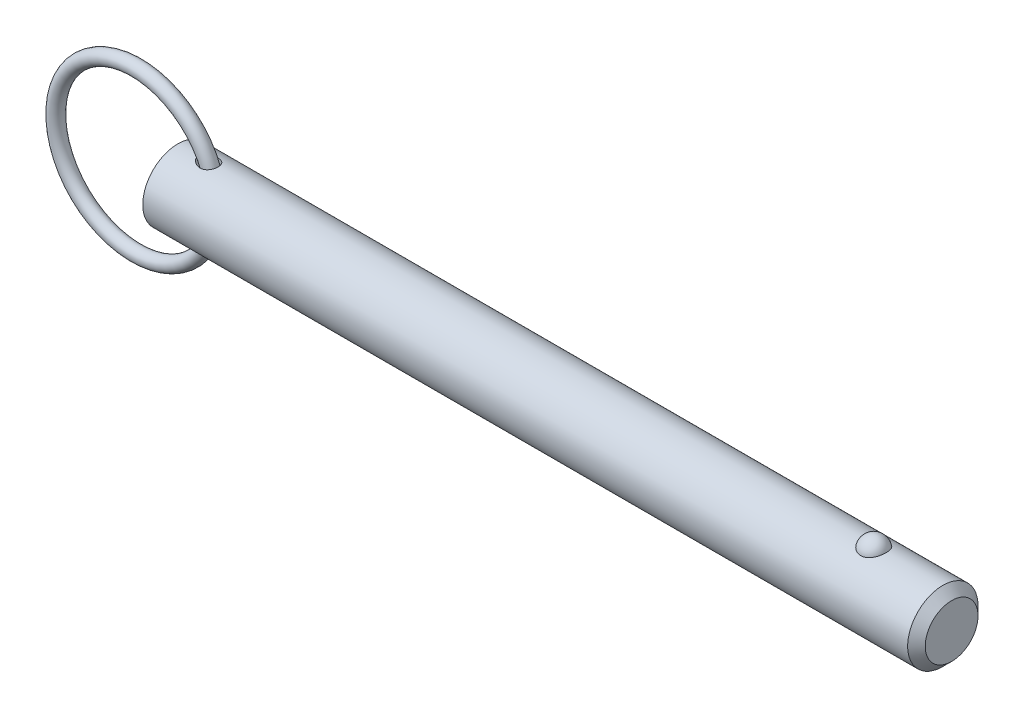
ISO-10303-21;
HEADER;
FILE_DESCRIPTION(('STEP AP214'),'2;1');
FILE_NAME('part.step','',(''),(''),'','','');
FILE_SCHEMA(('AUTOMOTIVE_DESIGN { 1 0 10303 214 1 1 1 1 }'));
ENDSEC;
DATA;
#1=APPLICATION_CONTEXT('core data for automotive mechanical design processes');
#2=APPLICATION_PROTOCOL_DEFINITION('international standard','automotive_design',2000,#1);
#3=PRODUCT_CONTEXT('',#1,'mechanical');
#4=PRODUCT('Part','Part','',(#3));
#5=PRODUCT_RELATED_PRODUCT_CATEGORY('part','',(#4));
#6=PRODUCT_DEFINITION_FORMATION('','',#4);
#7=PRODUCT_DEFINITION_CONTEXT('part definition',#1,'design');
#8=PRODUCT_DEFINITION('design','',#6,#7);
#9=PRODUCT_DEFINITION_SHAPE('','',#8);
#10=(LENGTH_UNIT() NAMED_UNIT(*) SI_UNIT(.MILLI.,.METRE.));
#11=(NAMED_UNIT(*) PLANE_ANGLE_UNIT() SI_UNIT($,.RADIAN.));
#12=(NAMED_UNIT(*) SI_UNIT($,.STERADIAN.) SOLID_ANGLE_UNIT());
#13=UNCERTAINTY_MEASURE_WITH_UNIT(LENGTH_MEASURE(1.E-05),#10,'distance_accuracy_value','');
#14=(GEOMETRIC_REPRESENTATION_CONTEXT(3) GLOBAL_UNCERTAINTY_ASSIGNED_CONTEXT((#13)) GLOBAL_UNIT_ASSIGNED_CONTEXT((#10,
#11,#12)) REPRESENTATION_CONTEXT('',''));
#15=CARTESIAN_POINT('',(0.,0.,0.));
#16=DIRECTION('',(0.,0.,1.));
#17=DIRECTION('',(1.,0.,0.));
#18=AXIS2_PLACEMENT_3D('',#15,#16,#17);
#19=CARTESIAN_POINT('',(-6.5973878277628,0.,0.));
#20=DIRECTION('',(0.,0.,1.));
#21=DIRECTION('',(1.,0.,0.));
#22=AXIS2_PLACEMENT_3D('',#19,#20,#21);
#23=TOROIDAL_SURFACE('',#22,12.7,1.111);
#24=CARTESIAN_POINT('',(7.21361217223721,0.,0.));
#25=VERTEX_POINT('',#24);
#26=VERTEX_LOOP('',#25);
#27=FACE_BOUND('',#26,.T.);
#28=ADVANCED_FACE('P0_F12',(#27),#23,.T.);
#29=CLOSED_SHELL('',(#28));
#30=MANIFOLD_SOLID_BREP('P0_B1',#29);
#31=CARTESIAN_POINT('',(0.,0.,0.));
#32=DIRECTION('',(1.,0.,0.));
#33=DIRECTION('',(0.,0.,-1.));
#34=AXIS2_PLACEMENT_3D('',#31,#32,#33);
#35=CYLINDRICAL_SURFACE('',#34,5.555);
#36=CARTESIAN_POINT('',(3.4079629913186,5.52646850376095,-0.56229074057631));
#37=CARTESIAN_POINT('',(3.45038002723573,5.51879026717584,-0.637753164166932));
#38=CARTESIAN_POINT('',(3.50032814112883,5.50998541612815,-0.70889136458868));
#39=CARTESIAN_POINT('',(3.61174203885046,5.49132550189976,-0.841353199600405));
#40=CARTESIAN_POINT('',(3.67323300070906,5.48146816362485,-0.902654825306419));
#41=CARTESIAN_POINT('',(3.80437942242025,5.46186986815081,-1.01449227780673));
#42=CARTESIAN_POINT('',(3.87396236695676,5.45212862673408,-1.06511378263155));
#43=CARTESIAN_POINT('',(4.01965973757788,5.43359578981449,-1.15594541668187));
#44=CARTESIAN_POINT('',(4.09577226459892,5.42480391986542,-1.19615855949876));
#45=CARTESIAN_POINT('',(4.26620236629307,5.40764958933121,-1.27165209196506));
#46=CARTESIAN_POINT('',(4.36143030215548,5.3996073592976,-1.30496908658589));
#47=CARTESIAN_POINT('',(4.55632904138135,5.38707461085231,-1.35578120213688));
#48=CARTESIAN_POINT('',(4.65600230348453,5.38258608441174,-1.37326745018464));
#49=CARTESIAN_POINT('',(4.85802759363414,5.37803111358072,-1.3910078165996));
#50=CARTESIAN_POINT('',(4.96039620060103,5.37800782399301,-1.39109376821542));
#51=CARTESIAN_POINT('',(5.16321961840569,5.38288845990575,-1.37209481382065));
#52=CARTESIAN_POINT('',(5.26367660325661,5.38778639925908,-1.3530331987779));
#53=CARTESIAN_POINT('',(5.44616808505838,5.40112654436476,-1.29866014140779));
#54=CARTESIAN_POINT('',(5.52893514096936,5.40904875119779,-1.26567968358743));
#55=CARTESIAN_POINT('',(5.68656142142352,5.4273273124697,-1.18484144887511));
#56=CARTESIAN_POINT('',(5.76142575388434,5.43768208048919,-1.13699336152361));
#57=CARTESIAN_POINT('',(5.8928378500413,5.45821422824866,-1.03362464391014));
#58=CARTESIAN_POINT('',(5.95048930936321,5.4682911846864,-0.979480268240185));
#59=CARTESIAN_POINT('',(6.05543937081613,5.48805232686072,-0.861887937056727));
#60=CARTESIAN_POINT('',(6.10274018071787,5.4977365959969,-0.798441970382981));
#61=CARTESIAN_POINT('',(6.18429732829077,5.51527779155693,-0.666351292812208));
#62=CARTESIAN_POINT('',(6.2189304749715,5.52318421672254,-0.597945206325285));
#63=CARTESIAN_POINT('',(6.27643902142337,5.53669785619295,-0.456146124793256));
#64=CARTESIAN_POINT('',(6.299314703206,5.54230512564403,-0.382753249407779));
#65=CARTESIAN_POINT('',(6.33280284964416,5.55061821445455,-0.232999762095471));
#66=CARTESIAN_POINT('',(6.34340498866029,5.55332159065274,-0.156636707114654));
#67=CARTESIAN_POINT('',(6.35208224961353,5.55552923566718,-0.00315477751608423));
#68=CARTESIAN_POINT('',(6.3501570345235,5.55503341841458,0.0739641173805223));
#69=CARTESIAN_POINT('',(6.33379320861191,5.55088854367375,0.22702996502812));
#70=CARTESIAN_POINT('',(6.31931424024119,5.54722931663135,0.302972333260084));
#71=CARTESIAN_POINT('',(6.27810810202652,5.53713917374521,0.451265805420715));
#72=CARTESIAN_POINT('',(6.25138106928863,5.53070828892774,0.523616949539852));
#73=CARTESIAN_POINT('',(6.18634700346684,5.51578851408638,0.662556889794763));
#74=CARTESIAN_POINT('',(6.14805666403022,5.50730259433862,0.729153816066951));
#75=CARTESIAN_POINT('',(6.0608417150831,5.4892059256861,0.854797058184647));
#76=CARTESIAN_POINT('',(6.01191805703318,5.47959527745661,0.91384404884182));
#77=CARTESIAN_POINT('',(5.90496974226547,5.46035411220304,1.0225462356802));
#78=CARTESIAN_POINT('',(5.84698163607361,5.45072382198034,1.07223745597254));
#79=CARTESIAN_POINT('',(5.72342907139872,5.43245016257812,1.16128533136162));
#80=CARTESIAN_POINT('',(5.65786492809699,5.42380675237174,1.20064241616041));
#81=CARTESIAN_POINT('',(5.52033184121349,5.40830592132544,1.26865612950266));
#82=CARTESIAN_POINT('',(5.44830127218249,5.40146883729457,1.29719236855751));
#83=CARTESIAN_POINT('',(5.30051649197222,5.39032432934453,1.34275086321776));
#84=CARTESIAN_POINT('',(5.22476137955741,5.38601752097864,1.35977031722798));
#85=CARTESIAN_POINT('',(5.06697568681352,5.38004503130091,1.3832203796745));
#86=CARTESIAN_POINT('',(4.98483834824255,5.37854992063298,1.38896799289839));
#87=CARTESIAN_POINT('',(4.82062075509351,5.37866467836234,1.38851901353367));
#88=CARTESIAN_POINT('',(4.73854053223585,5.38027567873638,1.38231806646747));
#89=CARTESIAN_POINT('',(4.56659703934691,5.38661928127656,1.35740374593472));
#90=CARTESIAN_POINT('',(4.47694676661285,5.39169506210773,1.33731128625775));
#91=CARTESIAN_POINT('',(4.30168169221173,5.40457769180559,1.28425210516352));
#92=CARTESIAN_POINT('',(4.2160714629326,5.41238755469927,1.25127117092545));
#93=CARTESIAN_POINT('',(4.04117722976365,5.43085841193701,1.16867508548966));
#94=CARTESIAN_POINT('',(3.95261220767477,5.44174460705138,1.11757796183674));
#95=CARTESIAN_POINT('',(3.78568183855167,5.46440376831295,1.00091858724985));
#96=CARTESIAN_POINT('',(3.70730710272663,5.47617590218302,0.935369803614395));
#97=CARTESIAN_POINT('',(3.5829937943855,5.49603821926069,0.809043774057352));
#98=CARTESIAN_POINT('',(3.5339020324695,5.50429522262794,0.751392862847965));
#99=CARTESIAN_POINT('',(3.44556991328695,5.51963490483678,0.628847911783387));
#100=CARTESIAN_POINT('',(3.40631385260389,5.52671944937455,0.563965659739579));
#101=CARTESIAN_POINT('',(3.34553998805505,5.5379053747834,0.439181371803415));
#102=CARTESIAN_POINT('',(3.32216705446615,5.5423057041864,0.380214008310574));
#103=CARTESIAN_POINT('',(3.2854368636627,5.54928356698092,0.259119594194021));
#104=CARTESIAN_POINT('',(3.27207322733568,5.5518622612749,0.196994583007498));
#105=CARTESIAN_POINT('',(3.25633559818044,5.5549036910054,0.0710541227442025));
#106=CARTESIAN_POINT('',(3.25400356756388,5.5553583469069,0.00723314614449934));
#107=CARTESIAN_POINT('',(3.26064251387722,5.55407150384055,-0.119787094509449));
#108=CARTESIAN_POINT('',(3.26961302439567,5.55233009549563,-0.182986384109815));
#109=CARTESIAN_POINT('',(3.29666795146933,5.54714559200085,-0.30051820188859));
#110=CARTESIAN_POINT('',(3.31373453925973,5.54389322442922,-0.355099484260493));
#111=CARTESIAN_POINT('',(3.35543396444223,5.53607951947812,-0.461174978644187));
#112=CARTESIAN_POINT('',(3.38007019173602,5.5315175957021,-0.512667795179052));
#113=CARTESIAN_POINT('',(3.4079629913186,5.52646850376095,-0.56229074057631));
#114=B_SPLINE_CURVE_WITH_KNOTS('',3,(#36,#37,#38,#39,#40,#41,#42,#43,#44,#45,#46,#47,#48,#49,
#50,#51,#52,#53,#54,#55,#56,#57,#58,#59,#60,#61,#62,#63,#64,#65,#66,#67,#68,#69,#70,#71,#72,#73,
#74,#75,#76,#77,#78,#79,#80,#81,#82,#83,#84,#85,#86,#87,#88,#89,#90,#91,#92,#93,#94,#95,#96,#97,
#98,#99,#100,#101,#102,#103,#104,#105,#106,#107,#108,#109,#110,#111,#112,#113),.UNSPECIFIED.,
.T.,.F.,(4,2,2,2,2,2,2,2,2,2,2,2,2,2,2,2,2,2,2,2,2,2,2,2,2,2,2,2,2,2,2,2,2,2,2,2,2,2,4),(0.,
0.260459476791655,0.521493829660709,0.780346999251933,1.03912513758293,1.34137402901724,
1.64379222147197,1.94913302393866,2.25410286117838,2.52092363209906,2.78757087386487,
3.0255756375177,3.26352958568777,3.49368251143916,3.72382991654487,3.9541708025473,
4.18451788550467,4.41560824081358,4.64669600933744,4.87745174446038,5.10818684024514,
5.33801446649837,5.56783253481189,5.80013729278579,6.03249854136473,6.27855081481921,
6.5246927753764,6.79963372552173,7.07487872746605,7.38193573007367,7.68870779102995,
7.91639390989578,8.14371416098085,8.33366541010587,8.52349549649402,8.71404708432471,
8.90459080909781,9.07578823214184,9.24706243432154),.UNSPECIFIED.);
#115=CARTESIAN_POINT('',(3.4079629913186,5.52646850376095,-0.56229074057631));
#116=VERTEX_POINT('',#115);
#117=EDGE_CURVE('P1_E40',#116,#116,#114,.T.);
#118=ORIENTED_EDGE('',*,*,#117,.T.);
#119=EDGE_LOOP('',(#118));
#120=FACE_BOUND('',#119,.T.);
#121=CARTESIAN_POINT('',(120.83125,0.,0.));
#122=DIRECTION('',(1.,0.,0.));
#123=DIRECTION('',(0.,0.,-1.));
#124=AXIS2_PLACEMENT_3D('',#121,#122,#123);
#125=CIRCLE('',#124,5.555);
#126=CARTESIAN_POINT('',(120.83125,0.,-5.555));
#127=VERTEX_POINT('',#126);
#128=EDGE_CURVE('P1_E25',#127,#127,#125,.T.);
#129=ORIENTED_EDGE('',*,*,#128,.F.);
#130=EDGE_LOOP('',(#129));
#131=FACE_BOUND('',#130,.T.);
#132=CARTESIAN_POINT('',(0.,0.,0.));
#133=DIRECTION('',(1.,0.,0.));
#134=DIRECTION('',(0.,0.,-1.));
#135=AXIS2_PLACEMENT_3D('',#132,#133,#134);
#136=CIRCLE('',#135,5.555);
#137=CARTESIAN_POINT('',(0.,0.,-5.555));
#138=VERTEX_POINT('',#137);
#139=EDGE_CURVE('P1_E9',#138,#138,#136,.T.);
#140=ORIENTED_EDGE('',*,*,#139,.T.);
#141=EDGE_LOOP('',(#140));
#142=FACE_BOUND('',#141,.T.);
#143=CARTESIAN_POINT('',(109.918626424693,5.16741224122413,2.03859650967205));
#144=CARTESIAN_POINT('',(109.812949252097,5.16740893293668,2.03859990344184));
#145=CARTESIAN_POINT('',(109.70729894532,5.17079470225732,2.03008306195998));
#146=CARTESIAN_POINT('',(109.499141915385,5.18392795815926,1.9963072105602));
#147=CARTESIAN_POINT('',(109.396634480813,5.19367399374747,1.9710520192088));
#148=CARTESIAN_POINT('',(109.197771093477,5.21839168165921,1.90463997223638));
#149=CARTESIAN_POINT('',(109.101406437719,5.23335573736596,1.86350622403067));
#150=CARTESIAN_POINT('',(108.917080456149,5.26688076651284,1.76652592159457));
#151=CARTESIAN_POINT('',(108.829120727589,5.28544242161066,1.71067657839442));
#152=CARTESIAN_POINT('',(108.661265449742,5.32479845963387,1.58399959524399));
#153=CARTESIAN_POINT('',(108.58166564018,5.34564089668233,1.51279545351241));
#154=CARTESIAN_POINT('',(108.43512901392,5.38697258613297,1.35828584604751));
#155=CARTESIAN_POINT('',(108.368194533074,5.40746177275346,1.27497815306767));
#156=CARTESIAN_POINT('',(108.24561039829,5.44694508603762,1.09440293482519));
#157=CARTESIAN_POINT('',(108.190598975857,5.46583143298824,0.996677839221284));
#158=CARTESIAN_POINT('',(108.096937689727,5.49908030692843,0.792961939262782));
#159=CARTESIAN_POINT('',(108.058289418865,5.513442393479,0.686970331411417));
#160=CARTESIAN_POINT('',(107.997680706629,5.536358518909,0.468019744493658));
#161=CARTESIAN_POINT('',(107.975972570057,5.54482455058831,0.35498154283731));
#162=CARTESIAN_POINT('',(107.950636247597,5.55473324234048,0.126595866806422));
#163=CARTESIAN_POINT('',(107.947007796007,5.55617600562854,0.0112484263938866));
#164=CARTESIAN_POINT('',(107.957881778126,5.55189984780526,-0.218011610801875));
#165=CARTESIAN_POINT('',(107.972315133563,5.54620821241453,-0.331928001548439));
#166=CARTESIAN_POINT('',(108.018903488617,5.52828920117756,-0.555544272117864));
#167=CARTESIAN_POINT('',(108.051058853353,5.5160616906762,-0.665244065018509));
#168=CARTESIAN_POINT('',(108.132488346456,5.48630779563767,-0.877469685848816));
#169=CARTESIAN_POINT('',(108.181781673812,5.4687754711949,-0.979987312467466));
#170=CARTESIAN_POINT('',(108.296478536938,5.43024700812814,-1.17486975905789));
#171=CARTESIAN_POINT('',(108.361883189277,5.4092506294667,-1.26723387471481));
#172=CARTESIAN_POINT('',(108.507571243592,5.36600927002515,-1.43940133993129));
#173=CARTESIAN_POINT('',(108.587885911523,5.34376173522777,-1.5191776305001));
#174=CARTESIAN_POINT('',(108.761452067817,5.30057971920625,-1.66360338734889));
#175=CARTESIAN_POINT('',(108.854702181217,5.27964509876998,-1.72825445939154));
#176=CARTESIAN_POINT('',(109.049393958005,5.24205250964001,-1.8390947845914));
#177=CARTESIAN_POINT('',(109.150590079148,5.22530519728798,-1.88568407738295));
#178=CARTESIAN_POINT('',(109.360155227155,5.19750919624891,-1.96100802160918));
#179=CARTESIAN_POINT('',(109.468521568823,5.18645838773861,-1.98974931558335));
#180=CARTESIAN_POINT('',(109.683498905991,5.17184410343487,-2.02742262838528));
#181=CARTESIAN_POINT('',(109.789925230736,5.16793282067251,-2.0372760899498));
#182=CARTESIAN_POINT('',(110.002992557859,5.1669899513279,-2.03966777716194));
#183=CARTESIAN_POINT('',(110.109633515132,5.16995704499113,-2.03220932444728));
#184=CARTESIAN_POINT('',(110.316773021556,5.18222383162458,-2.0007117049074));
#185=CARTESIAN_POINT('',(110.417359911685,5.19133213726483,-1.97717337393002));
#186=CARTESIAN_POINT('',(110.613014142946,5.21467637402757,-1.91475248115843));
#187=CARTESIAN_POINT('',(110.708081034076,5.22891272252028,-1.87586867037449));
#188=CARTESIAN_POINT('',(110.892371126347,5.26137066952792,-1.78282713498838));
#189=CARTESIAN_POINT('',(110.981419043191,5.27967329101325,-1.7283512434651));
#190=CARTESIAN_POINT('',(111.149288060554,5.31817411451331,-1.60597483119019));
#191=CARTESIAN_POINT('',(111.228106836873,5.33837274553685,-1.53807126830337));
#192=CARTESIAN_POINT('',(111.377515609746,5.37968287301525,-1.38688970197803));
#193=CARTESIAN_POINT('',(111.447505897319,5.40079011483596,-1.30301744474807));
#194=CARTESIAN_POINT('',(111.573012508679,5.44074401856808,-1.12458170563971));
#195=CARTESIAN_POINT('',(111.628526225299,5.4595902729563,-1.03001630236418));
#196=CARTESIAN_POINT('',(111.725550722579,5.49369849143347,-0.829439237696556));
#197=CARTESIAN_POINT('',(111.766548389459,5.50882422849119,-0.723155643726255));
#198=CARTESIAN_POINT('',(111.831125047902,5.53310911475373,-0.504772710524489));
#199=CARTESIAN_POINT('',(111.854703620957,5.54226812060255,-0.392673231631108));
#200=CARTESIAN_POINT('',(111.884013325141,5.55370358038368,-0.165459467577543));
#201=CARTESIAN_POINT('',(111.889688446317,5.55595843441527,-0.0503368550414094));
#202=CARTESIAN_POINT('',(111.882916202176,5.55329317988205,0.179288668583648));
#203=CARTESIAN_POINT('',(111.870469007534,5.54837313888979,0.293791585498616));
#204=CARTESIAN_POINT('',(111.827779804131,5.53189037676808,0.518526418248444));
#205=CARTESIAN_POINT('',(111.797598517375,5.5203503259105,0.62877154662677));
#206=CARTESIAN_POINT('',(111.720096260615,5.49182453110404,0.84231815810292));
#207=CARTESIAN_POINT('',(111.672774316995,5.47483847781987,0.945619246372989));
#208=CARTESIAN_POINT('',(111.561720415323,5.43710633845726,1.14281571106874));
#209=CARTESIAN_POINT('',(111.497921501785,5.41634501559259,1.23667048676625));
#210=CARTESIAN_POINT('',(111.355357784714,5.37334572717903,1.4118524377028));
#211=CARTESIAN_POINT('',(111.27659323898,5.35110778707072,1.49317982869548));
#212=CARTESIAN_POINT('',(111.106423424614,5.30779474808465,1.64049162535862));
#213=CARTESIAN_POINT('',(111.01510026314,5.28671324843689,1.70656877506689));
#214=CARTESIAN_POINT('',(110.821739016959,5.2480485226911,1.82201372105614));
#215=CARTESIAN_POINT('',(110.719700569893,5.23046541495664,1.87138095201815));
#216=CARTESIAN_POINT('',(110.503618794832,5.20042692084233,1.95335298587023));
#217=CARTESIAN_POINT('',(110.389260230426,5.18820192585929,1.98521734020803));
#218=CARTESIAN_POINT('',(110.156130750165,5.17169804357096,2.02783294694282));
#219=CARTESIAN_POINT('',(110.037361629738,5.16741595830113,2.03859269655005));
#220=CARTESIAN_POINT('',(109.918626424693,5.16741224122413,2.03859650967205));
#221=B_SPLINE_CURVE_WITH_KNOTS('',3,(#143,#144,#145,#146,#147,#148,#149,#150,#151,#152,#153,
#154,#155,#156,#157,#158,#159,#160,#161,#162,#163,#164,#165,#166,#167,#168,#169,#170,#171,#172,
#173,#174,#175,#176,#177,#178,#179,#180,#181,#182,#183,#184,#185,#186,#187,#188,#189,#190,#191,
#192,#193,#194,#195,#196,#197,#198,#199,#200,#201,#202,#203,#204,#205,#206,#207,#208,#209,#210,
#211,#212,#213,#214,#215,#216,#217,#218,#219,#220),.UNSPECIFIED.,.T.,.F.,(4,2,2,2,2,2,2,2,2,2,2,
2,2,2,2,2,2,2,2,2,2,2,2,2,2,2,2,2,2,2,2,2,2,2,2,2,2,2,4),(0.,0.316595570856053,
0.633118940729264,0.949183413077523,1.26530783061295,1.59030762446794,1.91536729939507,
2.25495824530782,2.59458224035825,2.93917283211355,3.28375835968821,3.62703002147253,
3.97030875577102,4.3139732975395,4.65766166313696,5.00207904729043,5.3464598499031,
5.68270547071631,6.0188258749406,6.33808403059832,6.65728093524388,6.96696376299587,
7.27667180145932,7.59321535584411,7.90983070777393,8.24210387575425,8.57443684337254,
8.91755896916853,9.26068933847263,9.60489211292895,9.949091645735,10.2921194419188,
10.6351667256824,10.9796305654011,11.324088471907,11.666392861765,12.0087088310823,
12.3645679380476,12.7202837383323),.UNSPECIFIED.);
#222=CARTESIAN_POINT('',(109.918626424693,5.16741224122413,2.03859650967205));
#223=VERTEX_POINT('',#222);
#224=EDGE_CURVE('P1_E34',#223,#223,#221,.T.);
#225=ORIENTED_EDGE('',*,*,#224,.T.);
#226=EDGE_LOOP('',(#225));
#227=FACE_BOUND('',#226,.T.);
#228=CARTESIAN_POINT('',(3.4079629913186,-5.52646850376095,-0.56229074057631));
#229=CARTESIAN_POINT('',(3.37716927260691,-5.53204268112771,-0.507507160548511));
#230=CARTESIAN_POINT('',(3.35034276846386,-5.53702335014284,-0.450440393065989));
#231=CARTESIAN_POINT('',(3.30606625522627,-5.54534377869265,-0.3326552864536));
#232=CARTESIAN_POINT('',(3.28860803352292,-5.5486849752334,-0.271940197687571));
#233=CARTESIAN_POINT('',(3.2642120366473,-5.55337514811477,-0.148013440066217));
#234=CARTESIAN_POINT('',(3.25732647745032,-5.55471423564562,-0.0847909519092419));
#235=CARTESIAN_POINT('',(3.25480623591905,-5.5552029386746,0.0418913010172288));
#236=CARTESIAN_POINT('',(3.25917102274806,-5.55435265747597,0.105351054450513));
#237=CARTESIAN_POINT('',(3.27824306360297,-5.55067444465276,0.227039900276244));
#238=CARTESIAN_POINT('',(3.29237198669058,-5.54795714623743,0.285365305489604));
#239=CARTESIAN_POINT('',(3.32941044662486,-5.54094262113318,0.399033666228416));
#240=CARTESIAN_POINT('',(3.3523223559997,-5.53664496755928,0.454375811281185));
#241=CARTESIAN_POINT('',(3.40768868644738,-5.52648234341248,0.56509977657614));
#242=CARTESIAN_POINT('',(3.44072521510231,-5.52052470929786,0.620179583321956));
#243=CARTESIAN_POINT('',(3.51400705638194,-5.50771567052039,0.725188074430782));
#244=CARTESIAN_POINT('',(3.55425830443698,-5.50086353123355,0.775112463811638));
#245=CARTESIAN_POINT('',(3.66122818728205,-5.48337209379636,0.891977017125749));
#246=CARTESIAN_POINT('',(3.73142715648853,-5.47248221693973,0.955709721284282));
#247=CARTESIAN_POINT('',(3.88137100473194,-5.45112279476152,1.07085228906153));
#248=CARTESIAN_POINT('',(3.96113047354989,-5.44065392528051,1.12224294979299));
#249=CARTESIAN_POINT('',(4.12858826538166,-5.42121387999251,1.21269344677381));
#250=CARTESIAN_POINT('',(4.21635930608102,-5.41225908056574,1.25162207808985));
#251=CARTESIAN_POINT('',(4.39702156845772,-5.39704895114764,1.31566440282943));
#252=CARTESIAN_POINT('',(4.48991226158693,-5.39079334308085,1.34077951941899));
#253=CARTESIAN_POINT('',(4.68604255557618,-5.38154547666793,1.37745897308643));
#254=CARTESIAN_POINT('',(4.78952677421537,-5.37884317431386,1.38782444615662));
#255=CARTESIAN_POINT('',(4.9967070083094,-5.3783992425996,1.38955482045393));
#256=CARTESIAN_POINT('',(5.10040282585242,-5.380654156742,1.380932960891));
#257=CARTESIAN_POINT('',(5.29344112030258,-5.3896561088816,1.34533259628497));
#258=CARTESIAN_POINT('',(5.38316618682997,-5.39591960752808,1.32032381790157));
#259=CARTESIAN_POINT('',(5.55593681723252,-5.41176992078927,1.25376768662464));
#260=CARTESIAN_POINT('',(5.63898852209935,-5.42135363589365,1.2122357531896));
#261=CARTESIAN_POINT('',(5.78518175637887,-5.4411584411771,1.1197110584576));
#262=CARTESIAN_POINT('',(5.84951468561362,-5.45115126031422,1.07054233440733));
#263=CARTESIAN_POINT('',(5.96832363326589,-5.47143247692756,0.961516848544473));
#264=CARTESIAN_POINT('',(6.02280238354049,-5.48172079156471,0.901663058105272));
#265=CARTESIAN_POINT('',(6.11773365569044,-5.50082367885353,0.776380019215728));
#266=CARTESIAN_POINT('',(6.15876077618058,-5.50968670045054,0.711392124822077));
#267=CARTESIAN_POINT('',(6.22940016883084,-5.52555592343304,0.575278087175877));
#268=CARTESIAN_POINT('',(6.25901321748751,-5.53256225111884,0.504152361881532));
#269=CARTESIAN_POINT('',(6.30603044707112,-5.54392803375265,0.35809068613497));
#270=CARTESIAN_POINT('',(6.32348246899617,-5.54829785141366,0.283170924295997));
#271=CARTESIAN_POINT('',(6.34598368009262,-5.5539654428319,0.131376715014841));
#272=CARTESIAN_POINT('',(6.35103253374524,-5.55526313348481,0.0545022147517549));
#273=CARTESIAN_POINT('',(6.34861245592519,-5.55464639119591,-0.0993401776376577));
#274=CARTESIAN_POINT('',(6.34109421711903,-5.5527193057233,-0.176307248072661));
#275=CARTESIAN_POINT('',(6.31360904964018,-5.54583593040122,-0.327847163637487));
#276=CARTESIAN_POINT('',(6.29364207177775,-5.54087962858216,-0.402419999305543));
#277=CARTESIAN_POINT('',(6.24170966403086,-5.52847553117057,-0.547041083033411));
#278=CARTESIAN_POINT('',(6.20974488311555,-5.52102787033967,-0.617089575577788));
#279=CARTESIAN_POINT('',(6.13458425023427,-5.5044595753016,-0.750655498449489));
#280=CARTESIAN_POINT('',(6.09138916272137,-5.49533905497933,-0.814173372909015));
#281=CARTESIAN_POINT('',(5.99508306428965,-5.47647644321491,-0.932642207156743));
#282=CARTESIAN_POINT('',(5.94201288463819,-5.46673701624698,-0.987626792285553));
#283=CARTESIAN_POINT('',(5.82732079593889,-5.4476756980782,-1.08787197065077));
#284=CARTESIAN_POINT('',(5.76569959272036,-5.43835377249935,-1.133133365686));
#285=CARTESIAN_POINT('',(5.63545565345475,-5.42108746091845,-1.2130627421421));
#286=CARTESIAN_POINT('',(5.56680798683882,-5.41314827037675,-1.24769112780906));
#287=CARTESIAN_POINT('',(5.42470366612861,-5.39946749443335,-1.30562834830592));
#288=CARTESIAN_POINT('',(5.35124627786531,-5.39372624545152,-1.32893545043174));
#289=CARTESIAN_POINT('',(5.19834649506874,-5.38471871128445,-1.36498831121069));
#290=CARTESIAN_POINT('',(5.11878242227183,-5.38156800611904,-1.37724301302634));
#291=CARTESIAN_POINT('',(4.95867408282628,-5.37830368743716,-1.38993264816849));
#292=CARTESIAN_POINT('',(4.87812945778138,-5.37819121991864,-1.39036312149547));
#293=CARTESIAN_POINT('',(4.70952450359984,-5.38096665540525,-1.37958681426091));
#294=CARTESIAN_POINT('',(4.62154757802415,-5.38416579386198,-1.36717293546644));
#295=CARTESIAN_POINT('',(4.44844201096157,-5.39350862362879,-1.32983172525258));
#296=CARTESIAN_POINT('',(4.36331534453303,-5.39965431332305,-1.30489590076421));
#297=CARTESIAN_POINT('',(4.18705584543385,-5.41508127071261,-1.23943340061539));
#298=CARTESIAN_POINT('',(4.09653169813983,-5.42466147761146,-1.19732979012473));
#299=CARTESIAN_POINT('',(3.92355621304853,-5.44542654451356,-1.09903394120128));
#300=CARTESIAN_POINT('',(3.84111059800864,-5.45661252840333,-1.04283181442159));
#301=CARTESIAN_POINT('',(3.69303712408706,-5.47835672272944,-0.921492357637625));
#302=CARTESIAN_POINT('',(3.62661543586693,-5.4888999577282,-0.857326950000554));
#303=CARTESIAN_POINT('',(3.50663841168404,-5.50887375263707,-0.717815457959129));
#304=CARTESIAN_POINT('',(3.45304856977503,-5.51830726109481,-0.642500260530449));
#305=CARTESIAN_POINT('',(3.4079629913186,-5.52646850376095,-0.56229074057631));
#306=B_SPLINE_CURVE_WITH_KNOTS('',3,(#228,#229,#230,#231,#232,#233,#234,#235,#236,#237,#238,
#239,#240,#241,#242,#243,#244,#245,#246,#247,#248,#249,#250,#251,#252,#253,#254,#255,#256,#257,
#258,#259,#260,#261,#262,#263,#264,#265,#266,#267,#268,#269,#270,#271,#272,#273,#274,#275,#276,
#277,#278,#279,#280,#281,#282,#283,#284,#285,#286,#287,#288,#289,#290,#291,#292,#293,#294,#295,
#296,#297,#298,#299,#300,#301,#302,#303,#304,#305),.UNSPECIFIED.,.T.,.F.,(4,2,2,2,2,2,2,2,2,2,2,
2,2,2,2,2,2,2,2,2,2,2,2,2,2,2,2,2,2,2,2,2,2,2,2,2,2,2,4),(0.,0.189054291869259,
0.377942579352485,0.567760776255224,0.757570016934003,0.937004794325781,1.11648807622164,
1.30929480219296,1.50226088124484,1.78704908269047,2.07227755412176,2.3604171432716,
2.64852704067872,2.95892962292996,3.26911584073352,3.5475451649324,3.82571526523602,
4.06921935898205,4.31265584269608,4.54364944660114,4.77462733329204,5.00469135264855,
5.23476159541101,5.46573664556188,5.69671260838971,5.92767607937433,6.15862383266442,
6.38863707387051,6.61863134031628,6.84947196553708,7.08034790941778,7.32103794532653,
7.56181876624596,7.82747997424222,8.09332161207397,8.39289891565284,8.69268692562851,
8.97023931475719,9.24703674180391),.UNSPECIFIED.);
#307=CARTESIAN_POINT('',(3.4079629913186,-5.52646850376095,-0.56229074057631));
#308=VERTEX_POINT('',#307);
#309=EDGE_CURVE('P1_E17',#308,#308,#306,.T.);
#310=ORIENTED_EDGE('',*,*,#309,.T.);
#311=EDGE_LOOP('',(#310));
#312=FACE_BOUND('',#311,.T.);
#313=ADVANCED_FACE('P1_F13',(#120,#131,#142,#227,#312),#35,.T.);
#314=CARTESIAN_POINT('',(0.,0.,0.));
#315=DIRECTION('',(-1.,0.,0.));
#316=DIRECTION('',(0.,0.,1.));
#317=AXIS2_PLACEMENT_3D('',#314,#315,#316);
#318=PLANE('',#317);
#319=ORIENTED_EDGE('',*,*,#139,.F.);
#320=EDGE_LOOP('',(#319));
#321=FACE_BOUND('',#320,.T.);
#322=ADVANCED_FACE('P1_F15',(#321),#318,.T.);
#323=CARTESIAN_POINT('',(122.22,0.,0.));
#324=DIRECTION('',(-1.,0.,0.));
#325=DIRECTION('',(0.,0.,1.));
#326=AXIS2_PLACEMENT_3D('',#323,#324,#325);
#327=CONICAL_SURFACE('',#326,4.16625000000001,0.78539816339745);
#328=ORIENTED_EDGE('',*,*,#128,.T.);
#329=EDGE_LOOP('',(#328));
#330=FACE_BOUND('',#329,.T.);
#331=CARTESIAN_POINT('',(122.22,0.,0.));
#332=DIRECTION('',(1.,0.,0.));
#333=DIRECTION('',(0.,0.,-1.));
#334=AXIS2_PLACEMENT_3D('',#331,#332,#333);
#335=CIRCLE('',#334,4.16625000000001);
#336=CARTESIAN_POINT('',(122.22,0.,-4.16625000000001));
#337=VERTEX_POINT('',#336);
#338=EDGE_CURVE('P1_E30',#337,#337,#335,.T.);
#339=ORIENTED_EDGE('',*,*,#338,.F.);
#340=EDGE_LOOP('',(#339));
#341=FACE_BOUND('',#340,.T.);
#342=ADVANCED_FACE('P1_F55',(#330,#341),#327,.T.);
#343=CARTESIAN_POINT('',(122.22,4.16625000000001,0.));
#344=DIRECTION('',(1.,0.,0.));
#345=DIRECTION('',(0.,0.,-1.));
#346=AXIS2_PLACEMENT_3D('',#343,#344,#345);
#347=PLANE('',#346);
#348=ORIENTED_EDGE('',*,*,#338,.T.);
#349=EDGE_LOOP('',(#348));
#350=FACE_BOUND('',#349,.T.);
#351=ADVANCED_FACE('P1_F51',(#350),#347,.T.);
#352=CARTESIAN_POINT('',(109.918626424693,4.9995,0.));
#353=DIRECTION('',(-1.,0.,0.));
#354=DIRECTION('',(0.,1.,0.));
#355=AXIS2_PLACEMENT_3D('',#352,#353,#354);
#356=SPHERICAL_SURFACE('',#355,2.04549999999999);
#357=ORIENTED_EDGE('',*,*,#224,.F.);
#358=EDGE_LOOP('',(#357));
#359=FACE_BOUND('',#358,.T.);
#360=ADVANCED_FACE('P1_F46',(#359),#356,.T.);
#361=CARTESIAN_POINT('',(-6.59738782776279,0.,0.));
#362=DIRECTION('',(0.,0.,1.));
#363=DIRECTION('',(1.,0.,0.));
#364=AXIS2_PLACEMENT_3D('',#361,#362,#363);
#365=TOROIDAL_SURFACE('',#364,12.7,1.38875);
#366=ORIENTED_EDGE('',*,*,#309,.F.);
#367=EDGE_LOOP('',(#366));
#368=FACE_BOUND('',#367,.T.);
#369=ORIENTED_EDGE('',*,*,#117,.F.);
#370=EDGE_LOOP('',(#369));
#371=FACE_BOUND('',#370,.T.);
#372=ADVANCED_FACE('P1_F50',(#368,#371),#365,.F.);
#373=CLOSED_SHELL('',(#313,#322,#342,#351,#360,#372));
#374=MANIFOLD_SOLID_BREP('P1_B1',#373);
#375=ADVANCED_BREP_SHAPE_REPRESENTATION('',(#18,#30,#374),#14);
#376=SHAPE_DEFINITION_REPRESENTATION(#9,#375);
ENDSEC;
END-ISO-10303-21;
